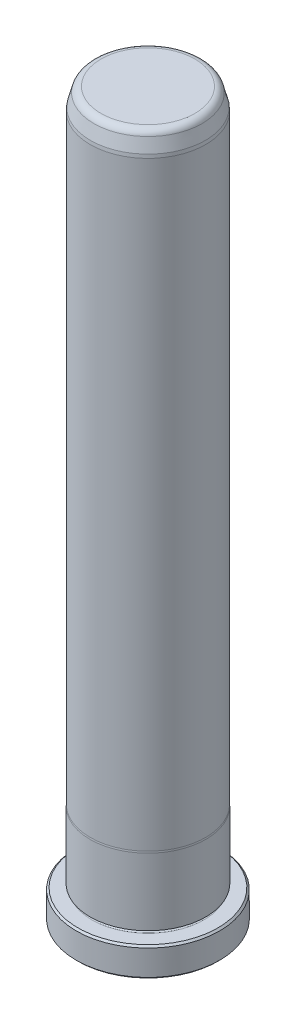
ISO-10303-21;
HEADER;
FILE_DESCRIPTION(('STEP AP214'),'2;1');
FILE_NAME('part.step','',(''),(''),'','','');
FILE_SCHEMA(('AUTOMOTIVE_DESIGN { 1 0 10303 214 1 1 1 1 }'));
ENDSEC;
DATA;
#1=APPLICATION_CONTEXT('core data for automotive mechanical design processes');
#2=APPLICATION_PROTOCOL_DEFINITION('international standard','automotive_design',2000,#1);
#3=PRODUCT_CONTEXT('',#1,'mechanical');
#4=PRODUCT('Part','Part','',(#3));
#5=PRODUCT_RELATED_PRODUCT_CATEGORY('part','',(#4));
#6=PRODUCT_DEFINITION_FORMATION('','',#4);
#7=PRODUCT_DEFINITION_CONTEXT('part definition',#1,'design');
#8=PRODUCT_DEFINITION('design','',#6,#7);
#9=PRODUCT_DEFINITION_SHAPE('','',#8);
#10=(LENGTH_UNIT() NAMED_UNIT(*) SI_UNIT(.MILLI.,.METRE.));
#11=(NAMED_UNIT(*) PLANE_ANGLE_UNIT() SI_UNIT($,.RADIAN.));
#12=(NAMED_UNIT(*) SI_UNIT($,.STERADIAN.) SOLID_ANGLE_UNIT());
#13=UNCERTAINTY_MEASURE_WITH_UNIT(LENGTH_MEASURE(1.E-05),#10,'distance_accuracy_value','');
#14=(GEOMETRIC_REPRESENTATION_CONTEXT(3) GLOBAL_UNCERTAINTY_ASSIGNED_CONTEXT((#13)) GLOBAL_UNIT_ASSIGNED_CONTEXT((#10,
#11,#12)) REPRESENTATION_CONTEXT('',''));
#15=CARTESIAN_POINT('',(0.,0.,0.));
#16=DIRECTION('',(0.,0.,1.));
#17=DIRECTION('',(1.,0.,0.));
#18=AXIS2_PLACEMENT_3D('',#15,#16,#17);
#19=CARTESIAN_POINT('',(0.,0.,0.));
#20=DIRECTION('',(0.,1.,0.));
#21=DIRECTION('',(0.,0.,1.));
#22=AXIS2_PLACEMENT_3D('',#19,#20,#21);
#23=PLANE('',#22);
#24=CARTESIAN_POINT('',(0.,0.,0.));
#25=DIRECTION('',(0.,1.,0.));
#26=DIRECTION('',(0.,0.,1.));
#27=AXIS2_PLACEMENT_3D('',#24,#25,#26);
#28=CIRCLE('',#27,15.3670000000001);
#29=CARTESIAN_POINT('',(0.,-2.4294440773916E-13,15.3670000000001));
#30=VERTEX_POINT('',#29);
#31=EDGE_CURVE('E37',#30,#30,#28,.F.);
#32=ORIENTED_EDGE('',*,*,#31,.T.);
#33=EDGE_LOOP('',(#32));
#34=FACE_BOUND('',#33,.T.);
#35=ADVANCED_FACE('F30',(#34),#23,.F.);
#36=CARTESIAN_POINT('',(0.,0.,0.));
#37=DIRECTION('',(0.,1.,0.));
#38=DIRECTION('',(0.,0.,1.));
#39=AXIS2_PLACEMENT_3D('',#36,#37,#38);
#40=CYLINDRICAL_SURFACE('',#39,15.748);
#41=CARTESIAN_POINT('',(0.,0.380999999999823,0.));
#42=DIRECTION('',(0.,1.,0.));
#43=DIRECTION('',(0.,0.,1.));
#44=AXIS2_PLACEMENT_3D('',#41,#42,#43);
#45=CIRCLE('',#44,15.748);
#46=CARTESIAN_POINT('',(0.,0.380999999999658,15.748));
#47=VERTEX_POINT('',#46);
#48=EDGE_CURVE('E41',#47,#47,#45,.T.);
#49=ORIENTED_EDGE('',*,*,#48,.T.);
#50=EDGE_LOOP('',(#49));
#51=FACE_BOUND('',#50,.T.);
#52=CARTESIAN_POINT('',(0.,5.9689999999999,0.));
#53=DIRECTION('',(0.,-1.,0.));
#54=DIRECTION('',(0.,0.,-1.));
#55=AXIS2_PLACEMENT_3D('',#52,#53,#54);
#56=CIRCLE('',#55,15.748);
#57=CARTESIAN_POINT('',(0.,5.96900000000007,-15.748));
#58=VERTEX_POINT('',#57);
#59=EDGE_CURVE('E45',#58,#58,#56,.T.);
#60=ORIENTED_EDGE('',*,*,#59,.T.);
#61=EDGE_LOOP('',(#60));
#62=FACE_BOUND('',#61,.T.);
#63=ADVANCED_FACE('F118',(#51,#62),#40,.T.);
#64=CARTESIAN_POINT('',(0.,6.35000000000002,-15.748));
#65=DIRECTION('',(0.,-1.,0.));
#66=DIRECTION('',(0.,0.,-1.));
#67=AXIS2_PLACEMENT_3D('',#64,#65,#66);
#68=PLANE('',#67);
#69=CARTESIAN_POINT('',(0.,6.34999999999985,0.));
#70=DIRECTION('',(0.,-1.,0.));
#71=DIRECTION('',(0.,0.,-1.));
#72=AXIS2_PLACEMENT_3D('',#69,#70,#71);
#73=CIRCLE('',#72,15.3670000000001);
#74=CARTESIAN_POINT('',(0.,6.35000000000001,-15.367));
#75=VERTEX_POINT('',#74);
#76=EDGE_CURVE('E10',#75,#75,#73,.F.);
#77=ORIENTED_EDGE('',*,*,#76,.T.);
#78=EDGE_LOOP('',(#77));
#79=FACE_BOUND('',#78,.T.);
#80=CARTESIAN_POINT('',(0.,6.34999999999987,0.));
#81=DIRECTION('',(0.,1.,0.));
#82=DIRECTION('',(0.,0.,1.));
#83=AXIS2_PLACEMENT_3D('',#80,#81,#82);
#84=CIRCLE('',#83,12.3063000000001);
#85=CARTESIAN_POINT('',(0.,6.34999999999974,12.3063000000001));
#86=VERTEX_POINT('',#85);
#87=EDGE_CURVE('E56',#86,#86,#84,.T.);
#88=ORIENTED_EDGE('',*,*,#87,.F.);
#89=EDGE_LOOP('',(#88));
#90=FACE_BOUND('',#89,.T.);
#91=ADVANCED_FACE('F113',(#79,#90),#68,.F.);
#92=CARTESIAN_POINT('',(0.,6.73099999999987,0.));
#93=DIRECTION('',(0.,1.,0.));
#94=DIRECTION('',(0.,0.,1.));
#95=AXIS2_PLACEMENT_3D('',#92,#93,#94);
#96=TOROIDAL_SURFACE('',#95,12.3063000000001,0.380999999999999);
#97=CARTESIAN_POINT('',(0.,7.11199999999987,0.));
#98=DIRECTION('',(0.,1.,0.));
#99=DIRECTION('',(0.,0.,1.));
#100=AXIS2_PLACEMENT_3D('',#97,#98,#99);
#101=CIRCLE('',#100,12.3063000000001);
#102=CARTESIAN_POINT('',(0.,7.11199999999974,12.3063000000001));
#103=VERTEX_POINT('',#102);
#104=EDGE_CURVE('E59',#103,#103,#101,.T.);
#105=ORIENTED_EDGE('',*,*,#104,.F.);
#106=EDGE_LOOP('',(#105));
#107=FACE_BOUND('',#106,.T.);
#108=ORIENTED_EDGE('',*,*,#87,.T.);
#109=EDGE_LOOP('',(#108));
#110=FACE_BOUND('',#109,.T.);
#111=ADVANCED_FACE('F107',(#107,#110),#96,.F.);
#112=CARTESIAN_POINT('',(0.,7.112,-12.3063));
#113=DIRECTION('',(0.,1.,0.));
#114=DIRECTION('',(0.,0.,1.));
#115=AXIS2_PLACEMENT_3D('',#112,#113,#114);
#116=PLANE('',#115);
#117=CARTESIAN_POINT('',(0.,7.11199999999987,0.));
#118=DIRECTION('',(0.,1.,0.));
#119=DIRECTION('',(0.,0.,1.));
#120=AXIS2_PLACEMENT_3D('',#117,#118,#119);
#121=CIRCLE('',#120,12.7127000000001);
#122=CARTESIAN_POINT('',(0.,7.11199999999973,12.7127000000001));
#123=VERTEX_POINT('',#122);
#124=EDGE_CURVE('E62',#123,#123,#121,.T.);
#125=ORIENTED_EDGE('',*,*,#124,.F.);
#126=EDGE_LOOP('',(#125));
#127=FACE_BOUND('',#126,.T.);
#128=ORIENTED_EDGE('',*,*,#104,.T.);
#129=EDGE_LOOP('',(#128));
#130=FACE_BOUND('',#129,.T.);
#131=ADVANCED_FACE('F101',(#127,#130),#116,.F.);
#132=CARTESIAN_POINT('',(0.,0.,0.));
#133=DIRECTION('',(0.,1.,0.));
#134=DIRECTION('',(0.,0.,1.));
#135=AXIS2_PLACEMENT_3D('',#132,#133,#134);
#136=CYLINDRICAL_SURFACE('',#135,12.7127000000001);
#137=CARTESIAN_POINT('',(0.,21.8617630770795,2.28526874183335E-13));
#138=DIRECTION('',(0.,1.,0.));
#139=DIRECTION('',(0.,0.,1.));
#140=AXIS2_PLACEMENT_3D('',#137,#138,#139);
#141=CIRCLE('',#140,12.7127000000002);
#142=CARTESIAN_POINT('',(0.,21.8617630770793,12.7127000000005));
#143=VERTEX_POINT('',#142);
#144=EDGE_CURVE('E65',#143,#143,#141,.T.);
#145=ORIENTED_EDGE('',*,*,#144,.F.);
#146=EDGE_LOOP('',(#145));
#147=FACE_BOUND('',#146,.T.);
#148=ORIENTED_EDGE('',*,*,#124,.T.);
#149=EDGE_LOOP('',(#148));
#150=FACE_BOUND('',#149,.T.);
#151=ADVANCED_FACE('F95',(#147,#150),#136,.T.);
#152=CARTESIAN_POINT('',(0.,21.8617630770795,2.28526874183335E-13));
#153=DIRECTION('',(0.,-1.,0.));
#154=DIRECTION('',(0.,0.,-1.));
#155=AXIS2_PLACEMENT_3D('',#152,#153,#154);
#156=CONICAL_SURFACE('',#155,12.7127000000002,0.069813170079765);
#157=CARTESIAN_POINT('',(0.,22.2249999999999,2.32323887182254E-13));
#158=DIRECTION('',(0.,1.,0.));
#159=DIRECTION('',(0.,0.,1.));
#160=AXIS2_PLACEMENT_3D('',#157,#158,#159);
#161=CIRCLE('',#160,12.6873000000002);
#162=CARTESIAN_POINT('',(0.,22.2249999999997,12.6873000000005));
#163=VERTEX_POINT('',#162);
#164=EDGE_CURVE('E68',#163,#163,#161,.T.);
#165=ORIENTED_EDGE('',*,*,#164,.F.);
#166=EDGE_LOOP('',(#165));
#167=FACE_BOUND('',#166,.T.);
#168=ORIENTED_EDGE('',*,*,#144,.T.);
#169=EDGE_LOOP('',(#168));
#170=FACE_BOUND('',#169,.T.);
#171=ADVANCED_FACE('F89',(#167,#170),#156,.T.);
#172=CARTESIAN_POINT('',(0.,0.,0.));
#173=DIRECTION('',(0.,1.,0.));
#174=DIRECTION('',(0.,0.,1.));
#175=AXIS2_PLACEMENT_3D('',#172,#173,#174);
#176=CYLINDRICAL_SURFACE('',#175,12.6873000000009);
#177=CARTESIAN_POINT('',(0.,154.0002,1.60980540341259E-12));
#178=DIRECTION('',(0.,1.,0.));
#179=DIRECTION('',(0.,0.,1.));
#180=AXIS2_PLACEMENT_3D('',#177,#178,#179);
#181=CIRCLE('',#180,12.6873000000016);
#182=CARTESIAN_POINT('',(0.,154.0002,12.6873000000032));
#183=VERTEX_POINT('',#182);
#184=EDGE_CURVE('E71',#183,#183,#181,.T.);
#185=ORIENTED_EDGE('',*,*,#184,.F.);
#186=EDGE_LOOP('',(#185));
#187=FACE_BOUND('',#186,.T.);
#188=ORIENTED_EDGE('',*,*,#164,.T.);
#189=EDGE_LOOP('',(#188));
#190=FACE_BOUND('',#189,.T.);
#191=ADVANCED_FACE('F83',(#187,#190),#176,.T.);
#192=CARTESIAN_POINT('',(0.,154.0002,1.60980540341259E-12));
#193=DIRECTION('',(0.,-1.,0.));
#194=DIRECTION('',(0.,0.,-1.));
#195=AXIS2_PLACEMENT_3D('',#192,#193,#194);
#196=CONICAL_SURFACE('',#195,12.6873000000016,0.0872664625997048);
#197=CARTESIAN_POINT('',(0.,154.7622,1.61777079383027E-12));
#198=DIRECTION('',(0.,1.,0.));
#199=DIRECTION('',(0.,0.,1.));
#200=AXIS2_PLACEMENT_3D('',#197,#198,#199);
#201=CIRCLE('',#200,12.6206336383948);
#202=CARTESIAN_POINT('',(0.,154.7622,12.6206336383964));
#203=VERTEX_POINT('',#202);
#204=EDGE_CURVE('E74',#203,#203,#201,.T.);
#205=ORIENTED_EDGE('',*,*,#204,.F.);
#206=EDGE_LOOP('',(#205));
#207=FACE_BOUND('',#206,.T.);
#208=ORIENTED_EDGE('',*,*,#184,.T.);
#209=EDGE_LOOP('',(#208));
#210=FACE_BOUND('',#209,.T.);
#211=ADVANCED_FACE('F80',(#207,#210),#196,.T.);
#212=CARTESIAN_POINT('',(0.,154.7622,1.61777079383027E-12));
#213=DIRECTION('',(0.,-1.,0.));
#214=DIRECTION('',(0.,0.,-1.));
#215=AXIS2_PLACEMENT_3D('',#212,#213,#214);
#216=CONICAL_SURFACE('',#215,12.6206336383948,0.261799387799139);
#217=CARTESIAN_POINT('',(0.,157.5733752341,1.64715676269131E-12));
#218=DIRECTION('',(0.,1.,0.));
#219=DIRECTION('',(0.,0.,1.));
#220=AXIS2_PLACEMENT_3D('',#217,#218,#219);
#221=CIRCLE('',#220,11.8673815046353);
#222=CARTESIAN_POINT('',(0.,157.5733752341,11.867381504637));
#223=VERTEX_POINT('',#222);
#224=EDGE_CURVE('E50',#223,#223,#221,.F.);
#225=ORIENTED_EDGE('',*,*,#224,.T.);
#226=EDGE_LOOP('',(#225));
#227=FACE_BOUND('',#226,.T.);
#228=ORIENTED_EDGE('',*,*,#204,.T.);
#229=EDGE_LOOP('',(#228));
#230=FACE_BOUND('',#229,.T.);
#231=ADVANCED_FACE('F78',(#227,#230),#216,.T.);
#232=CARTESIAN_POINT('',(0.,158.75,-11.5521058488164));
#233=DIRECTION('',(0.,-1.,0.));
#234=DIRECTION('',(0.,0.,-1.));
#235=AXIS2_PLACEMENT_3D('',#232,#233,#234);
#236=PLANE('',#235);
#237=CARTESIAN_POINT('',(0.,158.75,1.65945633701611E-12));
#238=DIRECTION('',(0.,-1.,0.));
#239=DIRECTION('',(0.,0.,-1.));
#240=AXIS2_PLACEMENT_3D('',#237,#238,#239);
#241=CIRCLE('',#240,10.3339742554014);
#242=CARTESIAN_POINT('',(0.,158.75,-10.3339742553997));
#243=VERTEX_POINT('',#242);
#244=EDGE_CURVE('E53',#243,#243,#241,.F.);
#245=ORIENTED_EDGE('',*,*,#244,.T.);
#246=EDGE_LOOP('',(#245));
#247=FACE_BOUND('',#246,.T.);
#248=ADVANCED_FACE('F133',(#247),#236,.F.);
#249=CARTESIAN_POINT('',(0.,157.1625,1.64286177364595E-12));
#250=DIRECTION('',(0.,-1.,0.));
#251=DIRECTION('',(0.,0.,-1.));
#252=AXIS2_PLACEMENT_3D('',#249,#250,#251);
#253=TOROIDAL_SURFACE('',#252,10.3339742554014,1.5875);
#254=ORIENTED_EDGE('',*,*,#224,.F.);
#255=EDGE_LOOP('',(#254));
#256=FACE_BOUND('',#255,.T.);
#257=ORIENTED_EDGE('',*,*,#244,.F.);
#258=EDGE_LOOP('',(#257));
#259=FACE_BOUND('',#258,.T.);
#260=ADVANCED_FACE('F130',(#256,#259),#253,.T.);
#261=CARTESIAN_POINT('',(0.,0.380999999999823,0.));
#262=DIRECTION('',(0.,1.,0.));
#263=DIRECTION('',(0.,0.,1.));
#264=AXIS2_PLACEMENT_3D('',#261,#262,#263);
#265=CONICAL_SURFACE('',#264,15.748,0.785398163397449);
#266=ORIENTED_EDGE('',*,*,#31,.F.);
#267=EDGE_LOOP('',(#266));
#268=FACE_BOUND('',#267,.T.);
#269=ORIENTED_EDGE('',*,*,#48,.F.);
#270=EDGE_LOOP('',(#269));
#271=FACE_BOUND('',#270,.T.);
#272=ADVANCED_FACE('F132',(#268,#271),#265,.T.);
#273=CARTESIAN_POINT('',(0.,6.34999999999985,0.));
#274=DIRECTION('',(0.,-1.,0.));
#275=DIRECTION('',(0.,0.,-1.));
#276=AXIS2_PLACEMENT_3D('',#273,#274,#275);
#277=CONICAL_SURFACE('',#276,15.3670000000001,0.785398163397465);
#278=ORIENTED_EDGE('',*,*,#59,.F.);
#279=EDGE_LOOP('',(#278));
#280=FACE_BOUND('',#279,.T.);
#281=ORIENTED_EDGE('',*,*,#76,.F.);
#282=EDGE_LOOP('',(#281));
#283=FACE_BOUND('',#282,.T.);
#284=ADVANCED_FACE('F32',(#280,#283),#277,.T.);
#285=CLOSED_SHELL('',(#35,#63,#91,#111,#131,#151,#171,#191,#211,#231,#248,#260,#272,#284));
#286=MANIFOLD_SOLID_BREP('B2',#285);
#287=ADVANCED_BREP_SHAPE_REPRESENTATION('',(#18,#286),#14);
#288=SHAPE_DEFINITION_REPRESENTATION(#9,#287);
ENDSEC;
END-ISO-10303-21;
